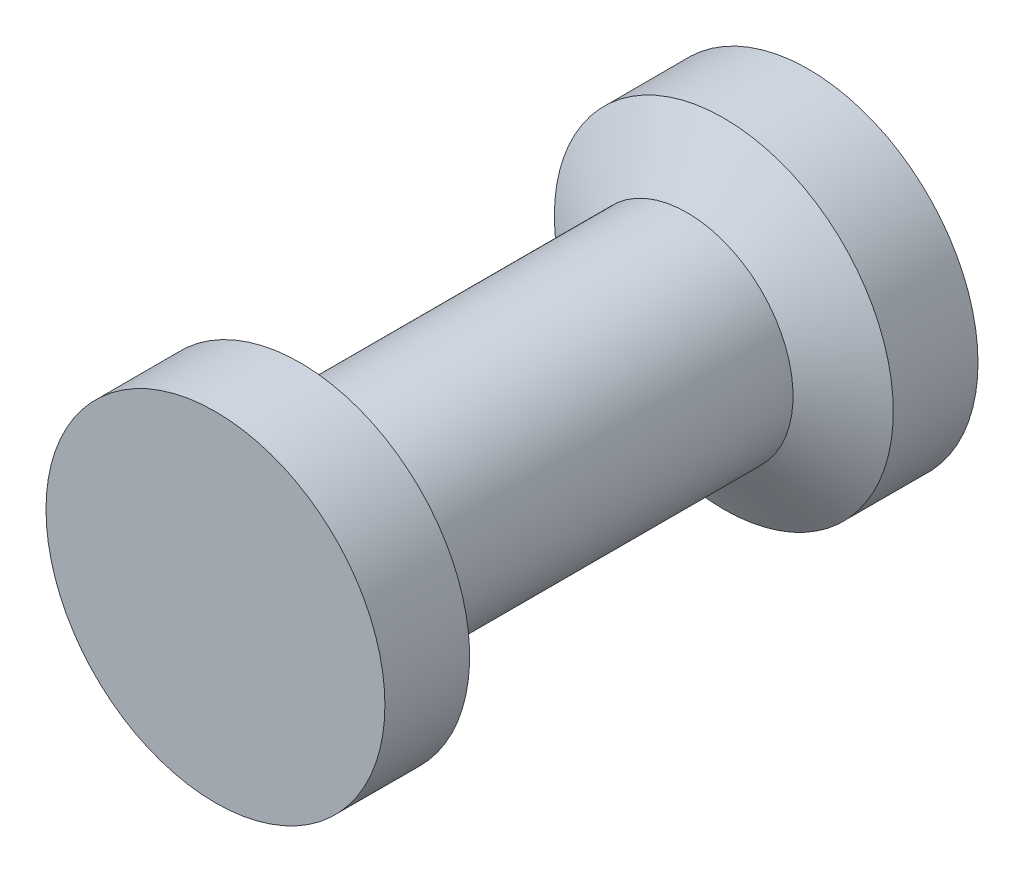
ISO-10303-21;
HEADER;
FILE_DESCRIPTION(('STEP AP214'),'2;1');
FILE_NAME('part.step','',(''),(''),'','','');
FILE_SCHEMA(('AUTOMOTIVE_DESIGN { 1 0 10303 214 1 1 1 1 }'));
ENDSEC;
DATA;
#1=APPLICATION_CONTEXT('core data for automotive mechanical design processes');
#2=APPLICATION_PROTOCOL_DEFINITION('international standard','automotive_design',2000,#1);
#3=PRODUCT_CONTEXT('',#1,'mechanical');
#4=PRODUCT('Part','Part','',(#3));
#5=PRODUCT_RELATED_PRODUCT_CATEGORY('part','',(#4));
#6=PRODUCT_DEFINITION_FORMATION('','',#4);
#7=PRODUCT_DEFINITION_CONTEXT('part definition',#1,'design');
#8=PRODUCT_DEFINITION('design','',#6,#7);
#9=PRODUCT_DEFINITION_SHAPE('','',#8);
#10=(LENGTH_UNIT() NAMED_UNIT(*) SI_UNIT(.MILLI.,.METRE.));
#11=(NAMED_UNIT(*) PLANE_ANGLE_UNIT() SI_UNIT($,.RADIAN.));
#12=(NAMED_UNIT(*) SI_UNIT($,.STERADIAN.) SOLID_ANGLE_UNIT());
#13=UNCERTAINTY_MEASURE_WITH_UNIT(LENGTH_MEASURE(1.E-05),#10,'distance_accuracy_value','');
#14=(GEOMETRIC_REPRESENTATION_CONTEXT(3) GLOBAL_UNCERTAINTY_ASSIGNED_CONTEXT((#13)) GLOBAL_UNIT_ASSIGNED_CONTEXT((#10,
#11,#12)) REPRESENTATION_CONTEXT('',''));
#15=CARTESIAN_POINT('',(0.,0.,0.));
#16=DIRECTION('',(0.,0.,1.));
#17=DIRECTION('',(1.,0.,0.));
#18=AXIS2_PLACEMENT_3D('',#15,#16,#17);
#19=CARTESIAN_POINT('',(0.,0.,120.));
#20=DIRECTION('',(0.,0.,-1.));
#21=DIRECTION('',(-1.,0.,0.));
#22=AXIS2_PLACEMENT_3D('',#19,#20,#21);
#23=CYLINDRICAL_SURFACE('',#22,25.);
#24=CARTESIAN_POINT('',(0.,0.,111.339745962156));
#25=DIRECTION('',(0.,0.,-1.));
#26=DIRECTION('',(-1.,0.,0.));
#27=AXIS2_PLACEMENT_3D('',#24,#25,#26);
#28=CIRCLE('',#27,25.);
#29=CARTESIAN_POINT('',(-25.,0.,111.339745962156));
#30=VERTEX_POINT('',#29);
#31=EDGE_CURVE('E58',#30,#30,#28,.T.);
#32=ORIENTED_EDGE('',*,*,#31,.T.);
#33=EDGE_LOOP('',(#32));
#34=FACE_BOUND('',#33,.T.);
#35=CARTESIAN_POINT('',(0.,0.,28.6602540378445));
#36=DIRECTION('',(0.,0.,-1.));
#37=DIRECTION('',(-1.,0.,0.));
#38=AXIS2_PLACEMENT_3D('',#35,#36,#37);
#39=CIRCLE('',#38,25.);
#40=CARTESIAN_POINT('',(-25.,0.,28.6602540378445));
#41=VERTEX_POINT('',#40);
#42=EDGE_CURVE('E52',#41,#41,#39,.T.);
#43=ORIENTED_EDGE('',*,*,#42,.F.);
#44=EDGE_LOOP('',(#43));
#45=FACE_BOUND('',#44,.T.);
#46=ADVANCED_FACE('F37',(#34,#45),#23,.T.);
#47=CARTESIAN_POINT('',(0.,0.,20.));
#48=DIRECTION('',(0.,0.,-1.));
#49=DIRECTION('',(-1.,0.,0.));
#50=AXIS2_PLACEMENT_3D('',#47,#48,#49);
#51=CONICAL_SURFACE('',#50,40.,1.04719755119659);
#52=ORIENTED_EDGE('',*,*,#42,.T.);
#53=EDGE_LOOP('',(#52));
#54=FACE_BOUND('',#53,.T.);
#55=CARTESIAN_POINT('',(0.,0.,20.));
#56=DIRECTION('',(0.,0.,1.));
#57=DIRECTION('',(1.,0.,0.));
#58=AXIS2_PLACEMENT_3D('',#55,#56,#57);
#59=CIRCLE('',#58,40.);
#60=CARTESIAN_POINT('',(40.,0.,20.));
#61=VERTEX_POINT('',#60);
#62=EDGE_CURVE('E10',#61,#61,#59,.T.);
#63=ORIENTED_EDGE('',*,*,#62,.T.);
#64=EDGE_LOOP('',(#63));
#65=FACE_BOUND('',#64,.T.);
#66=ADVANCED_FACE('F81',(#54,#65),#51,.T.);
#67=CARTESIAN_POINT('',(0.,0.,0.));
#68=DIRECTION('',(0.,0.,1.));
#69=DIRECTION('',(1.,0.,0.));
#70=AXIS2_PLACEMENT_3D('',#67,#68,#69);
#71=PLANE('',#70);
#72=CARTESIAN_POINT('',(0.,0.,0.));
#73=DIRECTION('',(0.,0.,1.));
#74=DIRECTION('',(1.,0.,0.));
#75=AXIS2_PLACEMENT_3D('',#72,#73,#74);
#76=CIRCLE('',#75,40.);
#77=CARTESIAN_POINT('',(40.,0.,0.));
#78=VERTEX_POINT('',#77);
#79=EDGE_CURVE('E41',#78,#78,#76,.T.);
#80=ORIENTED_EDGE('',*,*,#79,.F.);
#81=EDGE_LOOP('',(#80));
#82=FACE_BOUND('',#81,.T.);
#83=ADVANCED_FACE('F77',(#82),#71,.F.);
#84=CARTESIAN_POINT('',(0.,0.,20.));
#85=DIRECTION('',(0.,0.,-1.));
#86=DIRECTION('',(-1.,0.,0.));
#87=AXIS2_PLACEMENT_3D('',#84,#85,#86);
#88=CYLINDRICAL_SURFACE('',#87,40.);
#89=ORIENTED_EDGE('',*,*,#62,.F.);
#90=EDGE_LOOP('',(#89));
#91=FACE_BOUND('',#90,.T.);
#92=ORIENTED_EDGE('',*,*,#79,.T.);
#93=EDGE_LOOP('',(#92));
#94=FACE_BOUND('',#93,.T.);
#95=ADVANCED_FACE('F39',(#91,#94),#88,.T.);
#96=CARTESIAN_POINT('',(0.,0.,111.339745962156));
#97=DIRECTION('',(0.,0.,1.));
#98=DIRECTION('',(1.,0.,0.));
#99=AXIS2_PLACEMENT_3D('',#96,#97,#98);
#100=CONICAL_SURFACE('',#99,25.,1.04719755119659);
#101=CARTESIAN_POINT('',(0.,0.,120.));
#102=DIRECTION('',(0.,0.,-1.));
#103=DIRECTION('',(-1.,0.,0.));
#104=AXIS2_PLACEMENT_3D('',#101,#102,#103);
#105=CIRCLE('',#104,40.);
#106=CARTESIAN_POINT('',(-40.,0.,120.));
#107=VERTEX_POINT('',#106);
#108=EDGE_CURVE('E55',#107,#107,#105,.T.);
#109=ORIENTED_EDGE('',*,*,#108,.T.);
#110=EDGE_LOOP('',(#109));
#111=FACE_BOUND('',#110,.T.);
#112=ORIENTED_EDGE('',*,*,#31,.F.);
#113=EDGE_LOOP('',(#112));
#114=FACE_BOUND('',#113,.T.);
#115=ADVANCED_FACE('F64',(#111,#114),#100,.T.);
#116=CARTESIAN_POINT('',(0.,0.,140.));
#117=DIRECTION('',(0.,0.,1.));
#118=DIRECTION('',(1.,0.,0.));
#119=AXIS2_PLACEMENT_3D('',#116,#117,#118);
#120=PLANE('',#119);
#121=CARTESIAN_POINT('',(0.,0.,140.));
#122=DIRECTION('',(0.,0.,1.));
#123=DIRECTION('',(1.,0.,0.));
#124=AXIS2_PLACEMENT_3D('',#121,#122,#123);
#125=CIRCLE('',#124,40.);
#126=CARTESIAN_POINT('',(40.,0.,140.));
#127=VERTEX_POINT('',#126);
#128=EDGE_CURVE('E48',#127,#127,#125,.T.);
#129=ORIENTED_EDGE('',*,*,#128,.T.);
#130=EDGE_LOOP('',(#129));
#131=FACE_BOUND('',#130,.T.);
#132=ADVANCED_FACE('F66',(#131),#120,.T.);
#133=CARTESIAN_POINT('',(0.,0.,140.));
#134=DIRECTION('',(0.,0.,-1.));
#135=DIRECTION('',(-1.,0.,0.));
#136=AXIS2_PLACEMENT_3D('',#133,#134,#135);
#137=CYLINDRICAL_SURFACE('',#136,40.);
#138=ORIENTED_EDGE('',*,*,#128,.F.);
#139=EDGE_LOOP('',(#138));
#140=FACE_BOUND('',#139,.T.);
#141=ORIENTED_EDGE('',*,*,#108,.F.);
#142=EDGE_LOOP('',(#141));
#143=FACE_BOUND('',#142,.T.);
#144=ADVANCED_FACE('F73',(#140,#143),#137,.T.);
#145=CLOSED_SHELL('',(#46,#66,#83,#95,#115,#132,#144));
#146=MANIFOLD_SOLID_BREP('B2',#145);
#147=ADVANCED_BREP_SHAPE_REPRESENTATION('',(#18,#146),#14);
#148=SHAPE_DEFINITION_REPRESENTATION(#9,#147);
ENDSEC;
END-ISO-10303-21;
